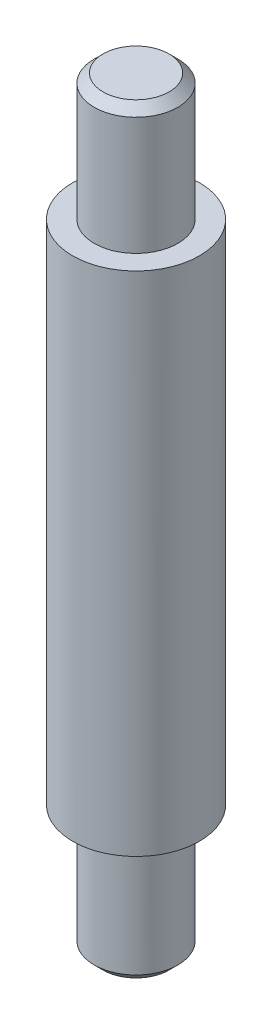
ISO-10303-21;
HEADER;
FILE_DESCRIPTION(('STEP AP214'),'2;1');
FILE_NAME('part.step','',(''),(''),'','','');
FILE_SCHEMA(('AUTOMOTIVE_DESIGN { 1 0 10303 214 1 1 1 1 }'));
ENDSEC;
DATA;
#1=APPLICATION_CONTEXT('core data for automotive mechanical design processes');
#2=APPLICATION_PROTOCOL_DEFINITION('international standard','automotive_design',2000,#1);
#3=PRODUCT_CONTEXT('',#1,'mechanical');
#4=PRODUCT('Part','Part','',(#3));
#5=PRODUCT_RELATED_PRODUCT_CATEGORY('part','',(#4));
#6=PRODUCT_DEFINITION_FORMATION('','',#4);
#7=PRODUCT_DEFINITION_CONTEXT('part definition',#1,'design');
#8=PRODUCT_DEFINITION('design','',#6,#7);
#9=PRODUCT_DEFINITION_SHAPE('','',#8);
#10=(LENGTH_UNIT() NAMED_UNIT(*) SI_UNIT(.MILLI.,.METRE.));
#11=(NAMED_UNIT(*) PLANE_ANGLE_UNIT() SI_UNIT($,.RADIAN.));
#12=(NAMED_UNIT(*) SI_UNIT($,.STERADIAN.) SOLID_ANGLE_UNIT());
#13=UNCERTAINTY_MEASURE_WITH_UNIT(LENGTH_MEASURE(1.E-05),#10,'distance_accuracy_value','');
#14=(GEOMETRIC_REPRESENTATION_CONTEXT(3) GLOBAL_UNCERTAINTY_ASSIGNED_CONTEXT((#13)) GLOBAL_UNIT_ASSIGNED_CONTEXT((#10,
#11,#12)) REPRESENTATION_CONTEXT('',''));
#15=CARTESIAN_POINT('',(0.,0.,0.));
#16=DIRECTION('',(0.,0.,1.));
#17=DIRECTION('',(1.,0.,0.));
#18=AXIS2_PLACEMENT_3D('',#15,#16,#17);
#19=CARTESIAN_POINT('',(0.,30.,0.));
#20=DIRECTION('',(0.,-1.,0.));
#21=DIRECTION('',(0.,0.,-1.));
#22=AXIS2_PLACEMENT_3D('',#19,#20,#21);
#23=CYLINDRICAL_SURFACE('',#22,2.5);
#24=CARTESIAN_POINT('',(0.,25.,0.));
#25=DIRECTION('',(0.,1.,0.));
#26=DIRECTION('',(0.,0.,1.));
#27=AXIS2_PLACEMENT_3D('',#24,#25,#26);
#28=CIRCLE('',#27,2.5);
#29=CARTESIAN_POINT('',(0.,25.,2.5));
#30=VERTEX_POINT('',#29);
#31=EDGE_CURVE('E51',#30,#30,#28,.T.);
#32=ORIENTED_EDGE('',*,*,#31,.F.);
#33=EDGE_LOOP('',(#32));
#34=FACE_BOUND('',#33,.T.);
#35=CARTESIAN_POINT('',(0.,5.,0.));
#36=DIRECTION('',(0.,-1.,0.));
#37=DIRECTION('',(0.,0.,-1.));
#38=AXIS2_PLACEMENT_3D('',#35,#36,#37);
#39=CIRCLE('',#38,2.5);
#40=CARTESIAN_POINT('',(0.,5.,-2.5));
#41=VERTEX_POINT('',#40);
#42=EDGE_CURVE('E52',#41,#41,#39,.T.);
#43=ORIENTED_EDGE('',*,*,#42,.F.);
#44=EDGE_LOOP('',(#43));
#45=FACE_BOUND('',#44,.T.);
#46=ADVANCED_FACE('F31',(#34,#45),#23,.T.);
#47=CARTESIAN_POINT('',(0.,25.,0.));
#48=DIRECTION('',(0.,1.,0.));
#49=DIRECTION('',(0.,0.,1.));
#50=AXIS2_PLACEMENT_3D('',#47,#48,#49);
#51=PLANE('',#50);
#52=CARTESIAN_POINT('',(0.,25.,0.));
#53=DIRECTION('',(0.,1.,0.));
#54=DIRECTION('',(0.,0.,1.));
#55=AXIS2_PLACEMENT_3D('',#52,#53,#54);
#56=CIRCLE('',#55,1.65);
#57=CARTESIAN_POINT('',(0.,25.,1.65));
#58=VERTEX_POINT('',#57);
#59=EDGE_CURVE('E55',#58,#58,#56,.T.);
#60=ORIENTED_EDGE('',*,*,#59,.F.);
#61=EDGE_LOOP('',(#60));
#62=FACE_BOUND('',#61,.T.);
#63=ORIENTED_EDGE('',*,*,#31,.T.);
#64=EDGE_LOOP('',(#63));
#65=FACE_BOUND('',#64,.T.);
#66=ADVANCED_FACE('F74',(#62,#65),#51,.T.);
#67=CARTESIAN_POINT('',(0.,25.,0.));
#68=DIRECTION('',(0.,1.,0.));
#69=DIRECTION('',(0.,0.,1.));
#70=AXIS2_PLACEMENT_3D('',#67,#68,#69);
#71=CYLINDRICAL_SURFACE('',#70,1.65);
#72=CARTESIAN_POINT('',(0.,29.65,0.));
#73=DIRECTION('',(0.,1.,0.));
#74=DIRECTION('',(0.,0.,1.));
#75=AXIS2_PLACEMENT_3D('',#72,#73,#74);
#76=CIRCLE('',#75,1.65);
#77=CARTESIAN_POINT('',(0.,29.65,1.65));
#78=VERTEX_POINT('',#77);
#79=EDGE_CURVE('E42',#78,#78,#76,.F.);
#80=ORIENTED_EDGE('',*,*,#79,.T.);
#81=EDGE_LOOP('',(#80));
#82=FACE_BOUND('',#81,.T.);
#83=ORIENTED_EDGE('',*,*,#59,.T.);
#84=EDGE_LOOP('',(#83));
#85=FACE_BOUND('',#84,.T.);
#86=ADVANCED_FACE('F80',(#82,#85),#71,.T.);
#87=CARTESIAN_POINT('',(0.,30.,0.));
#88=DIRECTION('',(0.,1.,0.));
#89=DIRECTION('',(0.,0.,1.));
#90=AXIS2_PLACEMENT_3D('',#87,#88,#89);
#91=PLANE('',#90);
#92=CARTESIAN_POINT('',(0.,30.,0.));
#93=DIRECTION('',(0.,1.,0.));
#94=DIRECTION('',(0.,0.,1.));
#95=AXIS2_PLACEMENT_3D('',#92,#93,#94);
#96=CIRCLE('',#95,1.3);
#97=CARTESIAN_POINT('',(0.,30.,1.3));
#98=VERTEX_POINT('',#97);
#99=EDGE_CURVE('E46',#98,#98,#96,.T.);
#100=ORIENTED_EDGE('',*,*,#99,.T.);
#101=EDGE_LOOP('',(#100));
#102=FACE_BOUND('',#101,.T.);
#103=ADVANCED_FACE('F69',(#102),#91,.T.);
#104=CARTESIAN_POINT('',(0.,5.,0.));
#105=DIRECTION('',(0.,-1.,0.));
#106=DIRECTION('',(0.,0.,-1.));
#107=AXIS2_PLACEMENT_3D('',#104,#105,#106);
#108=PLANE('',#107);
#109=CARTESIAN_POINT('',(0.,5.,0.));
#110=DIRECTION('',(0.,-1.,0.));
#111=DIRECTION('',(0.,0.,-1.));
#112=AXIS2_PLACEMENT_3D('',#109,#110,#111);
#113=CIRCLE('',#112,1.65);
#114=CARTESIAN_POINT('',(0.,5.,-1.65));
#115=VERTEX_POINT('',#114);
#116=EDGE_CURVE('E56',#115,#115,#113,.T.);
#117=ORIENTED_EDGE('',*,*,#116,.F.);
#118=EDGE_LOOP('',(#117));
#119=FACE_BOUND('',#118,.T.);
#120=ORIENTED_EDGE('',*,*,#42,.T.);
#121=EDGE_LOOP('',(#120));
#122=FACE_BOUND('',#121,.T.);
#123=ADVANCED_FACE('F66',(#119,#122),#108,.T.);
#124=CARTESIAN_POINT('',(0.,5.,0.));
#125=DIRECTION('',(0.,-1.,0.));
#126=DIRECTION('',(0.,0.,-1.));
#127=AXIS2_PLACEMENT_3D('',#124,#125,#126);
#128=CYLINDRICAL_SURFACE('',#127,1.65);
#129=CARTESIAN_POINT('',(0.,0.35,0.));
#130=DIRECTION('',(0.,1.,0.));
#131=DIRECTION('',(0.,0.,1.));
#132=AXIS2_PLACEMENT_3D('',#129,#130,#131);
#133=CIRCLE('',#132,1.65);
#134=CARTESIAN_POINT('',(0.,0.35,1.65));
#135=VERTEX_POINT('',#134);
#136=EDGE_CURVE('E10',#135,#135,#133,.T.);
#137=ORIENTED_EDGE('',*,*,#136,.T.);
#138=EDGE_LOOP('',(#137));
#139=FACE_BOUND('',#138,.T.);
#140=ORIENTED_EDGE('',*,*,#116,.T.);
#141=EDGE_LOOP('',(#140));
#142=FACE_BOUND('',#141,.T.);
#143=ADVANCED_FACE('F64',(#139,#142),#128,.T.);
#144=CARTESIAN_POINT('',(0.,0.,0.));
#145=DIRECTION('',(0.,1.,0.));
#146=DIRECTION('',(0.,0.,1.));
#147=AXIS2_PLACEMENT_3D('',#144,#145,#146);
#148=PLANE('',#147);
#149=CARTESIAN_POINT('',(0.,0.,0.));
#150=DIRECTION('',(0.,1.,0.));
#151=DIRECTION('',(0.,0.,1.));
#152=AXIS2_PLACEMENT_3D('',#149,#150,#151);
#153=CIRCLE('',#152,1.3);
#154=CARTESIAN_POINT('',(0.,0.,1.3));
#155=VERTEX_POINT('',#154);
#156=EDGE_CURVE('E38',#155,#155,#153,.F.);
#157=ORIENTED_EDGE('',*,*,#156,.T.);
#158=EDGE_LOOP('',(#157));
#159=FACE_BOUND('',#158,.T.);
#160=ADVANCED_FACE('F85',(#159),#148,.F.);
#161=CARTESIAN_POINT('',(0.,30.,0.));
#162=DIRECTION('',(0.,-1.,0.));
#163=DIRECTION('',(0.,0.,-1.));
#164=AXIS2_PLACEMENT_3D('',#161,#162,#163);
#165=CONICAL_SURFACE('',#164,1.3,0.78539816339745);
#166=ORIENTED_EDGE('',*,*,#79,.F.);
#167=EDGE_LOOP('',(#166));
#168=FACE_BOUND('',#167,.T.);
#169=ORIENTED_EDGE('',*,*,#99,.F.);
#170=EDGE_LOOP('',(#169));
#171=FACE_BOUND('',#170,.T.);
#172=ADVANCED_FACE('F87',(#168,#171),#165,.T.);
#173=CARTESIAN_POINT('',(0.,0.,0.));
#174=DIRECTION('',(0.,1.,0.));
#175=DIRECTION('',(0.,0.,1.));
#176=AXIS2_PLACEMENT_3D('',#173,#174,#175);
#177=CONICAL_SURFACE('',#176,1.3,0.785398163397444);
#178=ORIENTED_EDGE('',*,*,#136,.F.);
#179=EDGE_LOOP('',(#178));
#180=FACE_BOUND('',#179,.T.);
#181=ORIENTED_EDGE('',*,*,#156,.F.);
#182=EDGE_LOOP('',(#181));
#183=FACE_BOUND('',#182,.T.);
#184=ADVANCED_FACE('F33',(#180,#183),#177,.T.);
#185=CLOSED_SHELL('',(#46,#66,#86,#103,#123,#143,#160,#172,#184));
#186=MANIFOLD_SOLID_BREP('B2',#185);
#187=ADVANCED_BREP_SHAPE_REPRESENTATION('',(#18,#186),#14);
#188=SHAPE_DEFINITION_REPRESENTATION(#9,#187);
ENDSEC;
END-ISO-10303-21;
